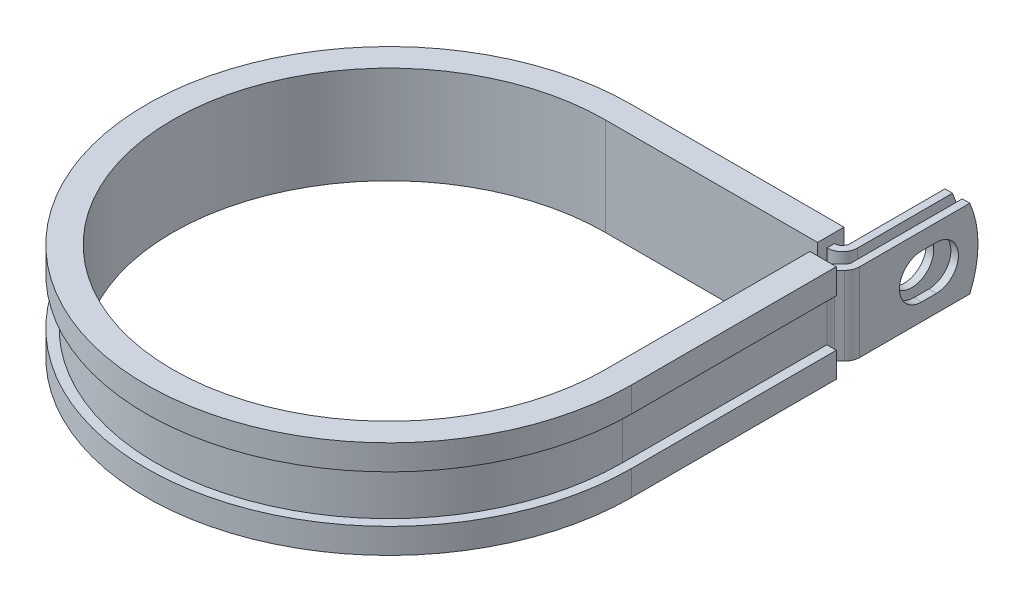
ISO-10303-21;
HEADER;
FILE_DESCRIPTION(('STEP AP214'),'2;1');
FILE_NAME('part.step','',(''),(''),'','','');
FILE_SCHEMA(('AUTOMOTIVE_DESIGN { 1 0 10303 214 1 1 1 1 }'));
ENDSEC;
DATA;
#1=APPLICATION_CONTEXT('core data for automotive mechanical design processes');
#2=APPLICATION_PROTOCOL_DEFINITION('international standard','automotive_design',2000,#1);
#3=PRODUCT_CONTEXT('',#1,'mechanical');
#4=PRODUCT('Part','Part','',(#3));
#5=PRODUCT_RELATED_PRODUCT_CATEGORY('part','',(#4));
#6=PRODUCT_DEFINITION_FORMATION('','',#4);
#7=PRODUCT_DEFINITION_CONTEXT('part definition',#1,'design');
#8=PRODUCT_DEFINITION('design','',#6,#7);
#9=PRODUCT_DEFINITION_SHAPE('','',#8);
#10=(LENGTH_UNIT() NAMED_UNIT(*) SI_UNIT(.MILLI.,.METRE.));
#11=(NAMED_UNIT(*) PLANE_ANGLE_UNIT() SI_UNIT($,.RADIAN.));
#12=(NAMED_UNIT(*) SI_UNIT($,.STERADIAN.) SOLID_ANGLE_UNIT());
#13=UNCERTAINTY_MEASURE_WITH_UNIT(LENGTH_MEASURE(1.E-05),#10,'distance_accuracy_value','');
#14=(GEOMETRIC_REPRESENTATION_CONTEXT(3) GLOBAL_UNCERTAINTY_ASSIGNED_CONTEXT((#13)) GLOBAL_UNIT_ASSIGNED_CONTEXT((#10,
#11,#12)) REPRESENTATION_CONTEXT('',''));
#15=CARTESIAN_POINT('',(0.,0.,0.));
#16=DIRECTION('',(0.,0.,1.));
#17=DIRECTION('',(1.,0.,0.));
#18=AXIS2_PLACEMENT_3D('',#15,#16,#17);
#19=CARTESIAN_POINT('',(37.1272698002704,-6.35,-36.449));
#20=DIRECTION('',(0.,1.,0.));
#21=DIRECTION('',(1.,0.,0.));
#22=AXIS2_PLACEMENT_3D('',#19,#20,#21);
#23=PLANE('',#22);
#24=DIRECTION('',(0.,0.,-1.));
#25=VECTOR('',#24,1.);
#26=CARTESIAN_POINT('',(34.2824698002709,-6.35,-36.449));
#27=LINE('',#26,#25);
#28=CARTESIAN_POINT('',(34.2824698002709,-6.35,-36.449));
#29=VERTEX_POINT('',#28);
#30=CARTESIAN_POINT('',(34.282469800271,-6.35,-37.6682));
#31=VERTEX_POINT('',#30);
#32=EDGE_CURVE('E523',#29,#31,#27,.T.);
#33=ORIENTED_EDGE('',*,*,#32,.T.);
#34=DIRECTION('',(1.,0.,0.));
#35=VECTOR('',#34,1.);
#36=CARTESIAN_POINT('',(0.,-6.35,-37.6682));
#37=LINE('',#36,#35);
#38=CARTESIAN_POINT('',(34.3332698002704,-6.35,-37.6682));
#39=VERTEX_POINT('',#38);
#40=EDGE_CURVE('E410',#39,#31,#37,.F.);
#41=ORIENTED_EDGE('',*,*,#40,.F.);
#42=CARTESIAN_POINT('',(34.3332698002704,-6.35,-38.8874));
#43=DIRECTION('',(0.,1.,0.));
#44=DIRECTION('',(1.,0.,0.));
#45=AXIS2_PLACEMENT_3D('',#42,#43,#44);
#46=CIRCLE('',#45,1.2192);
#47=CARTESIAN_POINT('',(35.5524698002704,-6.35,-38.8874));
#48=VERTEX_POINT('',#47);
#49=EDGE_CURVE('E408',#48,#39,#46,.F.);
#50=ORIENTED_EDGE('',*,*,#49,.F.);
#51=DIRECTION('',(0.,0.,-1.));
#52=VECTOR('',#51,1.);
#53=CARTESIAN_POINT('',(35.5524698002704,-6.35,-55.5498));
#54=LINE('',#53,#52);
#55=CARTESIAN_POINT('',(35.5524698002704,-6.35,-54.2244778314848));
#56=VERTEX_POINT('',#55);
#57=EDGE_CURVE('E406',#56,#48,#54,.F.);
#58=ORIENTED_EDGE('',*,*,#57,.F.);
#59=DIRECTION('',(-1.,0.,0.));
#60=VECTOR('',#59,1.);
#61=CARTESIAN_POINT('',(39.5656698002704,-6.35,-54.2244778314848));
#62=LINE('',#61,#60);
#63=CARTESIAN_POINT('',(36.7716698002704,-6.35,-54.2244778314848));
#64=VERTEX_POINT('',#63);
#65=EDGE_CURVE('E12',#64,#56,#62,.T.);
#66=ORIENTED_EDGE('',*,*,#65,.F.);
#67=DIRECTION('',(0.,0.,1.));
#68=VECTOR('',#67,1.);
#69=CARTESIAN_POINT('',(36.7716698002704,-6.35,-55.5498));
#70=LINE('',#69,#68);
#71=CARTESIAN_POINT('',(36.7716698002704,-6.35,-38.8874));
#72=VERTEX_POINT('',#71);
#73=EDGE_CURVE('E404',#64,#72,#70,.T.);
#74=ORIENTED_EDGE('',*,*,#73,.T.);
#75=CARTESIAN_POINT('',(34.3332698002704,-6.35,-38.8874));
#76=DIRECTION('',(0.,-1.,0.));
#77=DIRECTION('',(0.,0.,1.));
#78=AXIS2_PLACEMENT_3D('',#75,#76,#77);
#79=CIRCLE('',#78,2.4384);
#80=CARTESIAN_POINT('',(34.3332698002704,-6.35,-36.449));
#81=VERTEX_POINT('',#80);
#82=EDGE_CURVE('E401',#72,#81,#79,.T.);
#83=ORIENTED_EDGE('',*,*,#82,.T.);
#84=DIRECTION('',(-1.,0.,0.));
#85=VECTOR('',#84,1.);
#86=CARTESIAN_POINT('',(0.,-6.35,-36.449));
#87=LINE('',#86,#85);
#88=EDGE_CURVE('E398',#81,#29,#87,.T.);
#89=ORIENTED_EDGE('',*,*,#88,.T.);
#90=EDGE_LOOP('',(#33,#41,#50,#58,#66,#74,#83,#89));
#91=FACE_BOUND('',#90,.T.);
#92=ADVANCED_FACE('F54',(#91),#23,.F.);
#93=CARTESIAN_POINT('',(37.1272698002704,6.35,-36.449));
#94=DIRECTION('',(0.,1.,0.));
#95=DIRECTION('',(1.,0.,0.));
#96=AXIS2_PLACEMENT_3D('',#93,#94,#95);
#97=PLANE('',#96);
#98=DIRECTION('',(1.,0.,0.));
#99=VECTOR('',#98,1.);
#100=CARTESIAN_POINT('',(0.,6.35,-37.6682));
#101=LINE('',#100,#99);
#102=CARTESIAN_POINT('',(34.3332698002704,6.35,-37.6682));
#103=VERTEX_POINT('',#102);
#104=CARTESIAN_POINT('',(34.282469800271,6.35,-37.6682));
#105=VERTEX_POINT('',#104);
#106=EDGE_CURVE('E368',#103,#105,#101,.F.);
#107=ORIENTED_EDGE('',*,*,#106,.T.);
#108=DIRECTION('',(0.,0.,1.));
#109=VECTOR('',#108,1.);
#110=CARTESIAN_POINT('',(34.282469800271,6.35,-37.6682));
#111=LINE('',#110,#109);
#112=CARTESIAN_POINT('',(34.2824698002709,6.35,-36.449));
#113=VERTEX_POINT('',#112);
#114=EDGE_CURVE('E517',#105,#113,#111,.T.);
#115=ORIENTED_EDGE('',*,*,#114,.T.);
#116=DIRECTION('',(-1.,0.,0.));
#117=VECTOR('',#116,1.);
#118=CARTESIAN_POINT('',(0.,6.35,-36.449));
#119=LINE('',#118,#117);
#120=CARTESIAN_POINT('',(34.3332698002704,6.35,-36.449));
#121=VERTEX_POINT('',#120);
#122=EDGE_CURVE('E625',#121,#113,#119,.T.);
#123=ORIENTED_EDGE('',*,*,#122,.F.);
#124=CARTESIAN_POINT('',(34.3332698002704,6.35,-38.8874));
#125=DIRECTION('',(0.,-1.,0.));
#126=DIRECTION('',(0.,0.,1.));
#127=AXIS2_PLACEMENT_3D('',#124,#125,#126);
#128=CIRCLE('',#127,2.4384);
#129=CARTESIAN_POINT('',(36.7716698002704,6.35,-38.8874));
#130=VERTEX_POINT('',#129);
#131=EDGE_CURVE('E370',#130,#121,#128,.T.);
#132=ORIENTED_EDGE('',*,*,#131,.F.);
#133=DIRECTION('',(0.,0.,1.));
#134=VECTOR('',#133,1.);
#135=CARTESIAN_POINT('',(36.7716698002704,6.35,-55.5498));
#136=LINE('',#135,#134);
#137=CARTESIAN_POINT('',(36.7716698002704,6.35,-54.2244778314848));
#138=VERTEX_POINT('',#137);
#139=EDGE_CURVE('E361',#138,#130,#136,.T.);
#140=ORIENTED_EDGE('',*,*,#139,.F.);
#141=DIRECTION('',(-1.,0.,0.));
#142=VECTOR('',#141,1.);
#143=CARTESIAN_POINT('',(39.5656698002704,6.35,-54.2244778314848));
#144=LINE('',#143,#142);
#145=CARTESIAN_POINT('',(35.5524698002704,6.35,-54.2244778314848));
#146=VERTEX_POINT('',#145);
#147=EDGE_CURVE('E62',#138,#146,#144,.T.);
#148=ORIENTED_EDGE('',*,*,#147,.T.);
#149=DIRECTION('',(0.,0.,-1.));
#150=VECTOR('',#149,1.);
#151=CARTESIAN_POINT('',(35.5524698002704,6.35,-55.5498));
#152=LINE('',#151,#150);
#153=CARTESIAN_POINT('',(35.5524698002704,6.35,-38.8874));
#154=VERTEX_POINT('',#153);
#155=EDGE_CURVE('E358',#146,#154,#152,.F.);
#156=ORIENTED_EDGE('',*,*,#155,.T.);
#157=CARTESIAN_POINT('',(34.3332698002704,6.35,-38.8874));
#158=DIRECTION('',(0.,1.,0.));
#159=DIRECTION('',(1.,0.,0.));
#160=AXIS2_PLACEMENT_3D('',#157,#158,#159);
#161=CIRCLE('',#160,1.2192);
#162=EDGE_CURVE('E366',#154,#103,#161,.F.);
#163=ORIENTED_EDGE('',*,*,#162,.T.);
#164=EDGE_LOOP('',(#107,#115,#123,#132,#140,#148,#156,#163));
#165=FACE_BOUND('',#164,.T.);
#166=ADVANCED_FACE('F357',(#165),#97,.T.);
#167=CARTESIAN_POINT('',(0.,6.35,-36.449));
#168=DIRECTION('',(0.,0.,1.));
#169=DIRECTION('',(1.,0.,0.));
#170=AXIS2_PLACEMENT_3D('',#167,#168,#169);
#171=PLANE('',#170);
#172=ORIENTED_EDGE('',*,*,#122,.T.);
#173=DIRECTION('',(0.,-1.,0.));
#174=VECTOR('',#173,1.);
#175=CARTESIAN_POINT('',(34.2824698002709,6.35,-36.449));
#176=LINE('',#175,#174);
#177=EDGE_CURVE('E520',#113,#29,#176,.T.);
#178=ORIENTED_EDGE('',*,*,#177,.T.);
#179=ORIENTED_EDGE('',*,*,#88,.F.);
#180=DIRECTION('',(0.,-1.,0.));
#181=VECTOR('',#180,1.);
#182=CARTESIAN_POINT('',(34.3332698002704,6.35,-36.449));
#183=LINE('',#182,#181);
#184=EDGE_CURVE('E344',#121,#81,#183,.T.);
#185=ORIENTED_EDGE('',*,*,#184,.F.);
#186=EDGE_LOOP('',(#172,#178,#179,#185));
#187=FACE_BOUND('',#186,.T.);
#188=ADVANCED_FACE('F635',(#187),#171,.T.);
#189=CARTESIAN_POINT('',(39.5656698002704,6.35,-36.449));
#190=DIRECTION('',(-1.,0.,0.));
#191=DIRECTION('',(0.,0.,1.));
#192=AXIS2_PLACEMENT_3D('',#189,#190,#191);
#193=PLANE('',#192);
#194=CARTESIAN_POINT('',(39.5656698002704,0.,-48.8187999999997));
#195=DIRECTION('',(1.,0.,0.));
#196=DIRECTION('',(0.,0.,-1.));
#197=AXIS2_PLACEMENT_3D('',#194,#195,#196);
#198=CIRCLE('',#197,3.5687);
#199=CARTESIAN_POINT('',(39.5656698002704,-3.5687,-48.8188000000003));
#200=VERTEX_POINT('',#199);
#201=CARTESIAN_POINT('',(39.5656698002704,3.5687,-48.8188000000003));
#202=VERTEX_POINT('',#201);
#203=EDGE_CURVE('E580',#200,#202,#198,.T.);
#204=ORIENTED_EDGE('',*,*,#203,.F.);
#205=DIRECTION('',(0.,0.,-1.));
#206=VECTOR('',#205,1.);
#207=CARTESIAN_POINT('',(39.5656698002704,-3.5687,-46.4311999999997));
#208=LINE('',#207,#206);
#209=CARTESIAN_POINT('',(39.5656698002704,-3.5687,-46.4311999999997));
#210=VERTEX_POINT('',#209);
#211=EDGE_CURVE('E583',#210,#200,#208,.T.);
#212=ORIENTED_EDGE('',*,*,#211,.F.);
#213=CARTESIAN_POINT('',(39.5656698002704,0.,-46.4311999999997));
#214=DIRECTION('',(1.,0.,0.));
#215=DIRECTION('',(0.,0.,-1.));
#216=AXIS2_PLACEMENT_3D('',#213,#214,#215);
#217=CIRCLE('',#216,3.5687);
#218=CARTESIAN_POINT('',(39.5656698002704,3.5687,-46.4311999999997));
#219=VERTEX_POINT('',#218);
#220=EDGE_CURVE('E576',#219,#210,#217,.T.);
#221=ORIENTED_EDGE('',*,*,#220,.F.);
#222=DIRECTION('',(0.,0.,1.));
#223=VECTOR('',#222,1.);
#224=CARTESIAN_POINT('',(39.5656698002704,3.5687,-46.4311999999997));
#225=LINE('',#224,#223);
#226=EDGE_CURVE('E577',#202,#219,#225,.T.);
#227=ORIENTED_EDGE('',*,*,#226,.F.);
#228=EDGE_LOOP('',(#204,#212,#221,#227));
#229=FACE_BOUND('',#228,.T.);
#230=DIRECTION('',(0.,0.,-1.));
#231=VECTOR('',#230,1.);
#232=CARTESIAN_POINT('',(39.5656698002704,-6.35,-36.449));
#233=LINE('',#232,#231);
#234=CARTESIAN_POINT('',(39.5656698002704,-6.35,-36.449));
#235=VERTEX_POINT('',#234);
#236=CARTESIAN_POINT('',(39.5656698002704,-6.35,-54.2244778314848));
#237=VERTEX_POINT('',#236);
#238=EDGE_CURVE('E382',#235,#237,#233,.T.);
#239=ORIENTED_EDGE('',*,*,#238,.T.);
#240=CARTESIAN_POINT('',(39.5656698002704,0.,-39.6748));
#241=DIRECTION('',(-1.,0.,0.));
#242=DIRECTION('',(0.,0.,1.));
#243=AXIS2_PLACEMENT_3D('',#240,#241,#242);
#244=CIRCLE('',#243,15.875);
#245=CARTESIAN_POINT('',(39.5656698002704,6.35,-54.2244778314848));
#246=VERTEX_POINT('',#245);
#247=EDGE_CURVE('E568',#246,#237,#244,.T.);
#248=ORIENTED_EDGE('',*,*,#247,.F.);
#249=DIRECTION('',(0.,0.,-1.));
#250=VECTOR('',#249,1.);
#251=CARTESIAN_POINT('',(39.5656698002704,6.35,-36.449));
#252=LINE('',#251,#250);
#253=CARTESIAN_POINT('',(39.5656698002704,6.35,-36.449));
#254=VERTEX_POINT('',#253);
#255=EDGE_CURVE('E419',#254,#246,#252,.T.);
#256=ORIENTED_EDGE('',*,*,#255,.F.);
#257=DIRECTION('',(0.,-1.,0.));
#258=VECTOR('',#257,1.);
#259=CARTESIAN_POINT('',(39.5656698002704,6.35,-36.449));
#260=LINE('',#259,#258);
#261=EDGE_CURVE('E381',#254,#235,#260,.T.);
#262=ORIENTED_EDGE('',*,*,#261,.T.);
#263=EDGE_LOOP('',(#239,#248,#256,#262));
#264=FACE_BOUND('',#263,.T.);
#265=ADVANCED_FACE('F56',(#229,#264),#193,.F.);
#266=CARTESIAN_POINT('',(38.3464698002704,6.35,-36.449));
#267=DIRECTION('',(-1.,0.,0.));
#268=DIRECTION('',(0.,0.,1.));
#269=AXIS2_PLACEMENT_3D('',#266,#267,#268);
#270=PLANE('',#269);
#271=DIRECTION('',(0.,0.,-1.));
#272=VECTOR('',#271,1.);
#273=CARTESIAN_POINT('',(38.3464698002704,-3.5687,-46.4311999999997));
#274=LINE('',#273,#272);
#275=CARTESIAN_POINT('',(38.3464698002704,-3.5687,-46.4311999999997));
#276=VERTEX_POINT('',#275);
#277=CARTESIAN_POINT('',(38.3464698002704,-3.5687,-48.8188000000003));
#278=VERTEX_POINT('',#277);
#279=EDGE_CURVE('E579',#276,#278,#274,.T.);
#280=ORIENTED_EDGE('',*,*,#279,.T.);
#281=CARTESIAN_POINT('',(38.3464698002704,0.,-48.8187999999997));
#282=DIRECTION('',(-1.,0.,0.));
#283=DIRECTION('',(0.,0.,1.));
#284=AXIS2_PLACEMENT_3D('',#281,#282,#283);
#285=CIRCLE('',#284,3.5687);
#286=CARTESIAN_POINT('',(38.3464698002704,3.5687,-48.8188000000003));
#287=VERTEX_POINT('',#286);
#288=EDGE_CURVE('E600',#278,#287,#285,.F.);
#289=ORIENTED_EDGE('',*,*,#288,.T.);
#290=DIRECTION('',(0.,0.,1.));
#291=VECTOR('',#290,1.);
#292=CARTESIAN_POINT('',(38.3464698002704,3.5687,-46.4311999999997));
#293=LINE('',#292,#291);
#294=CARTESIAN_POINT('',(38.3464698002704,3.5687,-46.4311999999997));
#295=VERTEX_POINT('',#294);
#296=EDGE_CURVE('E596',#287,#295,#293,.T.);
#297=ORIENTED_EDGE('',*,*,#296,.T.);
#298=CARTESIAN_POINT('',(38.3464698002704,0.,-46.4311999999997));
#299=DIRECTION('',(-1.,0.,0.));
#300=DIRECTION('',(0.,0.,1.));
#301=AXIS2_PLACEMENT_3D('',#298,#299,#300);
#302=CIRCLE('',#301,3.5687);
#303=EDGE_CURVE('E591',#295,#276,#302,.F.);
#304=ORIENTED_EDGE('',*,*,#303,.T.);
#305=EDGE_LOOP('',(#280,#289,#297,#304));
#306=FACE_BOUND('',#305,.T.);
#307=CARTESIAN_POINT('',(38.3464698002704,0.,-39.6748));
#308=DIRECTION('',(-1.,0.,0.));
#309=DIRECTION('',(0.,0.,1.));
#310=AXIS2_PLACEMENT_3D('',#307,#308,#309);
#311=CIRCLE('',#310,15.875);
#312=CARTESIAN_POINT('',(38.3464698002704,6.35,-54.2244778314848));
#313=VERTEX_POINT('',#312);
#314=CARTESIAN_POINT('',(38.3464698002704,-6.35,-54.2244778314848));
#315=VERTEX_POINT('',#314);
#316=EDGE_CURVE('E76',#313,#315,#311,.T.);
#317=ORIENTED_EDGE('',*,*,#316,.T.);
#318=DIRECTION('',(0.,0.,-1.));
#319=VECTOR('',#318,1.);
#320=CARTESIAN_POINT('',(38.3464698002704,-6.35,-36.449));
#321=LINE('',#320,#319);
#322=CARTESIAN_POINT('',(38.3464698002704,-6.35,-36.449));
#323=VERTEX_POINT('',#322);
#324=EDGE_CURVE('E385',#323,#315,#321,.T.);
#325=ORIENTED_EDGE('',*,*,#324,.F.);
#326=DIRECTION('',(0.,-1.,0.));
#327=VECTOR('',#326,1.);
#328=CARTESIAN_POINT('',(38.3464698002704,6.35,-36.449));
#329=LINE('',#328,#327);
#330=CARTESIAN_POINT('',(38.3464698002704,6.35,-36.449));
#331=VERTEX_POINT('',#330);
#332=EDGE_CURVE('E352',#331,#323,#329,.T.);
#333=ORIENTED_EDGE('',*,*,#332,.F.);
#334=DIRECTION('',(0.,0.,-1.));
#335=VECTOR('',#334,1.);
#336=CARTESIAN_POINT('',(38.3464698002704,6.35,-36.449));
#337=LINE('',#336,#335);
#338=EDGE_CURVE('E615',#331,#313,#337,.T.);
#339=ORIENTED_EDGE('',*,*,#338,.T.);
#340=EDGE_LOOP('',(#317,#325,#333,#339));
#341=FACE_BOUND('',#340,.T.);
#342=ADVANCED_FACE('F689',(#306,#341),#270,.T.);
#343=CARTESIAN_POINT('',(36.7716698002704,6.35,-55.5498));
#344=DIRECTION('',(1.,0.,0.));
#345=DIRECTION('',(0.,0.,-1.));
#346=AXIS2_PLACEMENT_3D('',#343,#344,#345);
#347=PLANE('',#346);
#348=CARTESIAN_POINT('',(36.7716698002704,0.,-47.625));
#349=DIRECTION('',(1.,0.,0.));
#350=DIRECTION('',(0.,0.,-1.));
#351=AXIS2_PLACEMENT_3D('',#348,#349,#350);
#352=CIRCLE('',#351,3.5687);
#353=CARTESIAN_POINT('',(36.7716698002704,0.,-51.1937));
#354=VERTEX_POINT('',#353);
#355=EDGE_CURVE('E386',#354,#354,#352,.F.);
#356=ORIENTED_EDGE('',*,*,#355,.T.);
#357=EDGE_LOOP('',(#356));
#358=FACE_BOUND('',#357,.T.);
#359=ORIENTED_EDGE('',*,*,#73,.F.);
#360=CARTESIAN_POINT('',(36.7716698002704,0.,-39.6748));
#361=DIRECTION('',(1.,0.,0.));
#362=DIRECTION('',(0.,0.,-1.));
#363=AXIS2_PLACEMENT_3D('',#360,#361,#362);
#364=CIRCLE('',#363,15.875);
#365=EDGE_CURVE('E573',#64,#138,#364,.T.);
#366=ORIENTED_EDGE('',*,*,#365,.T.);
#367=ORIENTED_EDGE('',*,*,#139,.T.);
#368=DIRECTION('',(0.,-1.,0.));
#369=VECTOR('',#368,1.);
#370=CARTESIAN_POINT('',(36.7716698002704,6.35,-38.8874));
#371=LINE('',#370,#369);
#372=EDGE_CURVE('E341',#130,#72,#371,.T.);
#373=ORIENTED_EDGE('',*,*,#372,.T.);
#374=EDGE_LOOP('',(#359,#366,#367,#373));
#375=FACE_BOUND('',#374,.T.);
#376=ADVANCED_FACE('F641',(#358,#375),#347,.T.);
#377=CARTESIAN_POINT('',(35.5524698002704,6.35,-55.5498));
#378=DIRECTION('',(1.,0.,0.));
#379=DIRECTION('',(0.,0.,-1.));
#380=AXIS2_PLACEMENT_3D('',#377,#378,#379);
#381=PLANE('',#380);
#382=CARTESIAN_POINT('',(35.5524698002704,0.,-47.625));
#383=DIRECTION('',(-1.,0.,0.));
#384=DIRECTION('',(0.,0.,1.));
#385=AXIS2_PLACEMENT_3D('',#382,#383,#384);
#386=CIRCLE('',#385,3.5687);
#387=CARTESIAN_POINT('',(35.5524698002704,0.,-44.0563));
#388=VERTEX_POINT('',#387);
#389=EDGE_CURVE('E608',#388,#388,#386,.T.);
#390=ORIENTED_EDGE('',*,*,#389,.F.);
#391=EDGE_LOOP('',(#390));
#392=FACE_BOUND('',#391,.T.);
#393=CARTESIAN_POINT('',(35.5524698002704,0.,-39.6748));
#394=DIRECTION('',(-1.,0.,0.));
#395=DIRECTION('',(0.,0.,1.));
#396=AXIS2_PLACEMENT_3D('',#393,#394,#395);
#397=CIRCLE('',#396,15.875);
#398=EDGE_CURVE('E68',#146,#56,#397,.T.);
#399=ORIENTED_EDGE('',*,*,#398,.T.);
#400=ORIENTED_EDGE('',*,*,#57,.T.);
#401=DIRECTION('',(0.,-1.,0.));
#402=VECTOR('',#401,1.);
#403=CARTESIAN_POINT('',(35.5524698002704,6.35,-38.8874));
#404=LINE('',#403,#402);
#405=EDGE_CURVE('E338',#154,#48,#404,.T.);
#406=ORIENTED_EDGE('',*,*,#405,.F.);
#407=ORIENTED_EDGE('',*,*,#155,.F.);
#408=EDGE_LOOP('',(#399,#400,#406,#407));
#409=FACE_BOUND('',#408,.T.);
#410=ADVANCED_FACE('F364',(#392,#409),#381,.F.);
#411=CARTESIAN_POINT('',(38.8874,-6.35,-33.0365026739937));
#412=DIRECTION('',(0.,1.,0.));
#413=DIRECTION('',(1.,0.,0.));
#414=AXIS2_PLACEMENT_3D('',#411,#412,#413);
#415=CIRCLE('',#414,1.2192);
#416=CARTESIAN_POINT('',(37.6682,-6.35,-33.0365026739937));
#417=VERTEX_POINT('',#416);
#418=CARTESIAN_POINT('',(38.0252954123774,-6.35,-33.8986072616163));
#419=VERTEX_POINT('',#418);
#420=EDGE_CURVE('E413',#417,#419,#415,.F.);
#421=ORIENTED_EDGE('',*,*,#420,.F.);
#422=DIRECTION('',(1.,0.,0.));
#423=VECTOR('',#422,1.);
#424=CARTESIAN_POINT('',(36.449,-6.35,-33.0365026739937));
#425=LINE('',#424,#423);
#426=CARTESIAN_POINT('',(36.449,-6.35,-33.0365026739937));
#427=VERTEX_POINT('',#426);
#428=EDGE_CURVE('E451',#427,#417,#425,.T.);
#429=ORIENTED_EDGE('',*,*,#428,.F.);
#430=CARTESIAN_POINT('',(38.8874,-6.35,-33.0365026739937));
#431=DIRECTION('',(0.,-1.,0.));
#432=DIRECTION('',(0.,0.,1.));
#433=AXIS2_PLACEMENT_3D('',#430,#431,#432);
#434=CIRCLE('',#433,2.4384);
#435=CARTESIAN_POINT('',(37.1631908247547,-6.35,-34.760711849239));
#436=VERTEX_POINT('',#435);
#437=EDGE_CURVE('E395',#427,#436,#434,.T.);
#438=ORIENTED_EDGE('',*,*,#437,.T.);
#439=DIRECTION('',(0.707106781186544,0.,-0.70710678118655));
#440=VECTOR('',#439,1.);
#441=CARTESIAN_POINT('',(37.1631908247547,-6.35,-34.760711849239));
#442=LINE('',#441,#440);
#443=CARTESIAN_POINT('',(37.9893743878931,-6.35,-35.5868954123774));
#444=VERTEX_POINT('',#443);
#445=EDGE_CURVE('E392',#436,#444,#442,.T.);
#446=ORIENTED_EDGE('',*,*,#445,.T.);
#447=CARTESIAN_POINT('',(37.1272698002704,-6.35,-36.449));
#448=DIRECTION('',(0.,1.,0.));
#449=DIRECTION('',(0.,0.,1.));
#450=AXIS2_PLACEMENT_3D('',#447,#448,#449);
#451=CIRCLE('',#450,1.2192);
#452=EDGE_CURVE('E389',#444,#323,#451,.T.);
#453=ORIENTED_EDGE('',*,*,#452,.T.);
#454=ORIENTED_EDGE('',*,*,#324,.T.);
#455=DIRECTION('',(-1.,0.,0.));
#456=VECTOR('',#455,1.);
#457=CARTESIAN_POINT('',(39.5656698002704,-6.35,-54.2244778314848));
#458=LINE('',#457,#456);
#459=EDGE_CURVE('E566',#237,#315,#458,.T.);
#460=ORIENTED_EDGE('',*,*,#459,.F.);
#461=ORIENTED_EDGE('',*,*,#238,.F.);
#462=CARTESIAN_POINT('',(37.1272698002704,-6.35,-36.449));
#463=DIRECTION('',(0.,1.,0.));
#464=DIRECTION('',(1.,0.,0.));
#465=AXIS2_PLACEMENT_3D('',#462,#463,#464);
#466=CIRCLE('',#465,2.4384);
#467=CARTESIAN_POINT('',(38.8514789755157,-6.35,-34.7247908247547));
#468=VERTEX_POINT('',#467);
#469=EDGE_CURVE('E417',#468,#235,#466,.T.);
#470=ORIENTED_EDGE('',*,*,#469,.F.);
#471=DIRECTION('',(0.707106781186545,0.,-0.707106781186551));
#472=VECTOR('',#471,1.);
#473=CARTESIAN_POINT('',(38.0252954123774,-6.35,-33.8986072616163));
#474=LINE('',#473,#472);
#475=EDGE_CURVE('E415',#419,#468,#474,.T.);
#476=ORIENTED_EDGE('',*,*,#475,.F.);
#477=EDGE_LOOP('',(#421,#429,#438,#446,#453,#454,#460,#461,#470,#476));
#478=FACE_BOUND('',#477,.T.);
#479=ADVANCED_FACE('F675',(#478),#23,.F.);
#480=DIRECTION('',(-1.,0.,0.));
#481=VECTOR('',#480,1.);
#482=CARTESIAN_POINT('',(37.6682,6.35,-33.0365026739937));
#483=LINE('',#482,#481);
#484=CARTESIAN_POINT('',(37.6682,6.35,-33.0365026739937));
#485=VERTEX_POINT('',#484);
#486=CARTESIAN_POINT('',(36.449,6.35,-33.0365026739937));
#487=VERTEX_POINT('',#486);
#488=EDGE_CURVE('E440',#485,#487,#483,.T.);
#489=ORIENTED_EDGE('',*,*,#488,.F.);
#490=CARTESIAN_POINT('',(38.8874,6.35,-33.0365026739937));
#491=DIRECTION('',(0.,1.,0.));
#492=DIRECTION('',(1.,0.,0.));
#493=AXIS2_PLACEMENT_3D('',#490,#491,#492);
#494=CIRCLE('',#493,1.2192);
#495=CARTESIAN_POINT('',(38.0252954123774,6.35,-33.8986072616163));
#496=VERTEX_POINT('',#495);
#497=EDGE_CURVE('E375',#485,#496,#494,.F.);
#498=ORIENTED_EDGE('',*,*,#497,.T.);
#499=DIRECTION('',(0.707106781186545,0.,-0.707106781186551));
#500=VECTOR('',#499,1.);
#501=CARTESIAN_POINT('',(38.0252954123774,6.35,-33.8986072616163));
#502=LINE('',#501,#500);
#503=CARTESIAN_POINT('',(38.8514789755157,6.35,-34.7247908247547));
#504=VERTEX_POINT('',#503);
#505=EDGE_CURVE('E377',#496,#504,#502,.T.);
#506=ORIENTED_EDGE('',*,*,#505,.T.);
#507=CARTESIAN_POINT('',(37.1272698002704,6.35,-36.449));
#508=DIRECTION('',(0.,1.,0.));
#509=DIRECTION('',(1.,0.,0.));
#510=AXIS2_PLACEMENT_3D('',#507,#508,#509);
#511=CIRCLE('',#510,2.4384);
#512=EDGE_CURVE('E379',#504,#254,#511,.T.);
#513=ORIENTED_EDGE('',*,*,#512,.T.);
#514=ORIENTED_EDGE('',*,*,#255,.T.);
#515=DIRECTION('',(-1.,0.,0.));
#516=VECTOR('',#515,1.);
#517=CARTESIAN_POINT('',(39.5656698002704,6.35,-54.2244778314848));
#518=LINE('',#517,#516);
#519=EDGE_CURVE('E570',#246,#313,#518,.T.);
#520=ORIENTED_EDGE('',*,*,#519,.T.);
#521=ORIENTED_EDGE('',*,*,#338,.F.);
#522=CARTESIAN_POINT('',(37.1272698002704,6.35,-36.449));
#523=DIRECTION('',(0.,1.,0.));
#524=DIRECTION('',(0.,0.,1.));
#525=AXIS2_PLACEMENT_3D('',#522,#523,#524);
#526=CIRCLE('',#525,1.2192);
#527=CARTESIAN_POINT('',(37.9893743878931,6.35,-35.5868954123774));
#528=VERTEX_POINT('',#527);
#529=EDGE_CURVE('E618',#528,#331,#526,.T.);
#530=ORIENTED_EDGE('',*,*,#529,.F.);
#531=DIRECTION('',(0.707106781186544,0.,-0.70710678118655));
#532=VECTOR('',#531,1.);
#533=CARTESIAN_POINT('',(37.1631908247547,6.35,-34.760711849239));
#534=LINE('',#533,#532);
#535=CARTESIAN_POINT('',(37.1631908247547,6.35,-34.760711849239));
#536=VERTEX_POINT('',#535);
#537=EDGE_CURVE('E621',#536,#528,#534,.T.);
#538=ORIENTED_EDGE('',*,*,#537,.F.);
#539=CARTESIAN_POINT('',(38.8874,6.35,-33.0365026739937));
#540=DIRECTION('',(0.,-1.,0.));
#541=DIRECTION('',(0.,0.,1.));
#542=AXIS2_PLACEMENT_3D('',#539,#540,#541);
#543=CIRCLE('',#542,2.4384);
#544=EDGE_CURVE('E450',#487,#536,#543,.T.);
#545=ORIENTED_EDGE('',*,*,#544,.F.);
#546=EDGE_LOOP('',(#489,#498,#506,#513,#514,#520,#521,#530,#538,#545));
#547=FACE_BOUND('',#546,.T.);
#548=ADVANCED_FACE('F447',(#547),#97,.T.);
#549=CARTESIAN_POINT('',(37.1272698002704,6.35,-36.449));
#550=DIRECTION('',(0.,-1.,0.));
#551=DIRECTION('',(0.,0.,-1.));
#552=AXIS2_PLACEMENT_3D('',#549,#550,#551);
#553=CYLINDRICAL_SURFACE('',#552,1.2192);
#554=ORIENTED_EDGE('',*,*,#452,.F.);
#555=DIRECTION('',(0.,-1.,0.));
#556=VECTOR('',#555,1.);
#557=CARTESIAN_POINT('',(37.9893743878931,6.35,-35.5868954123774));
#558=LINE('',#557,#556);
#559=EDGE_CURVE('E350',#528,#444,#558,.T.);
#560=ORIENTED_EDGE('',*,*,#559,.F.);
#561=ORIENTED_EDGE('',*,*,#529,.T.);
#562=ORIENTED_EDGE('',*,*,#332,.T.);
#563=EDGE_LOOP('',(#554,#560,#561,#562));
#564=FACE_BOUND('',#563,.T.);
#565=ADVANCED_FACE('F685',(#564),#553,.F.);
#566=CARTESIAN_POINT('',(37.1631908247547,6.35,-34.760711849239));
#567=DIRECTION('',(-0.707106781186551,0.,-0.707106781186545));
#568=DIRECTION('',(-0.707106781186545,0.,0.707106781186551));
#569=AXIS2_PLACEMENT_3D('',#566,#567,#568);
#570=PLANE('',#569);
#571=ORIENTED_EDGE('',*,*,#445,.F.);
#572=DIRECTION('',(0.,-1.,0.));
#573=VECTOR('',#572,1.);
#574=CARTESIAN_POINT('',(37.1631908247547,6.35,-34.760711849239));
#575=LINE('',#574,#573);
#576=EDGE_CURVE('E348',#536,#436,#575,.T.);
#577=ORIENTED_EDGE('',*,*,#576,.F.);
#578=ORIENTED_EDGE('',*,*,#537,.T.);
#579=ORIENTED_EDGE('',*,*,#559,.T.);
#580=EDGE_LOOP('',(#571,#577,#578,#579));
#581=FACE_BOUND('',#580,.T.);
#582=ADVANCED_FACE('F680',(#581),#570,.T.);
#583=CARTESIAN_POINT('',(38.8874,6.35,-33.0365026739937));
#584=DIRECTION('',(0.,-1.,0.));
#585=DIRECTION('',(0.,0.,-1.));
#586=AXIS2_PLACEMENT_3D('',#583,#584,#585);
#587=CYLINDRICAL_SURFACE('',#586,2.4384);
#588=ORIENTED_EDGE('',*,*,#437,.F.);
#589=DIRECTION('',(0.,-1.,0.));
#590=VECTOR('',#589,1.);
#591=CARTESIAN_POINT('',(36.449,6.35,-33.0365026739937));
#592=LINE('',#591,#590);
#593=EDGE_CURVE('E346',#487,#427,#592,.T.);
#594=ORIENTED_EDGE('',*,*,#593,.F.);
#595=ORIENTED_EDGE('',*,*,#544,.T.);
#596=ORIENTED_EDGE('',*,*,#576,.T.);
#597=EDGE_LOOP('',(#588,#594,#595,#596));
#598=FACE_BOUND('',#597,.T.);
#599=ADVANCED_FACE('F677',(#598),#587,.T.);
#600=CARTESIAN_POINT('',(34.3332698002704,6.35,-38.8874));
#601=DIRECTION('',(0.,-1.,0.));
#602=DIRECTION('',(0.,0.,-1.));
#603=AXIS2_PLACEMENT_3D('',#600,#601,#602);
#604=CYLINDRICAL_SURFACE('',#603,2.4384);
#605=ORIENTED_EDGE('',*,*,#82,.F.);
#606=ORIENTED_EDGE('',*,*,#372,.F.);
#607=ORIENTED_EDGE('',*,*,#131,.T.);
#608=ORIENTED_EDGE('',*,*,#184,.T.);
#609=EDGE_LOOP('',(#605,#606,#607,#608));
#610=FACE_BOUND('',#609,.T.);
#611=ADVANCED_FACE('F631',(#610),#604,.T.);
#612=CARTESIAN_POINT('',(34.3332698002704,6.35,-38.8874));
#613=DIRECTION('',(0.,-1.,0.));
#614=DIRECTION('',(0.,0.,-1.));
#615=AXIS2_PLACEMENT_3D('',#612,#613,#614);
#616=CYLINDRICAL_SURFACE('',#615,1.2192);
#617=ORIENTED_EDGE('',*,*,#49,.T.);
#618=DIRECTION('',(0.,-1.,0.));
#619=VECTOR('',#618,1.);
#620=CARTESIAN_POINT('',(34.3332698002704,6.35,-37.6682));
#621=LINE('',#620,#619);
#622=EDGE_CURVE('E329',#103,#39,#621,.T.);
#623=ORIENTED_EDGE('',*,*,#622,.F.);
#624=ORIENTED_EDGE('',*,*,#162,.F.);
#625=ORIENTED_EDGE('',*,*,#405,.T.);
#626=EDGE_LOOP('',(#617,#623,#624,#625));
#627=FACE_BOUND('',#626,.T.);
#628=ADVANCED_FACE('F646',(#627),#616,.F.);
#629=CARTESIAN_POINT('',(0.,6.35,-37.6682));
#630=DIRECTION('',(0.,0.,1.));
#631=DIRECTION('',(1.,0.,0.));
#632=AXIS2_PLACEMENT_3D('',#629,#630,#631);
#633=PLANE('',#632);
#634=DIRECTION('',(0.,-1.,0.));
#635=VECTOR('',#634,1.);
#636=CARTESIAN_POINT('',(0.,6.35,-37.6682));
#637=LINE('',#636,#635);
#638=CARTESIAN_POINT('',(5.28377781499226E-13,3.81,-37.6682));
#639=VERTEX_POINT('',#638);
#640=CARTESIAN_POINT('',(5.28377781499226E-13,-3.81,-37.6682));
#641=VERTEX_POINT('',#640);
#642=EDGE_CURVE('E320',#639,#641,#637,.T.);
#643=ORIENTED_EDGE('',*,*,#642,.F.);
#644=DIRECTION('',(1.,0.,0.));
#645=VECTOR('',#644,1.);
#646=CARTESIAN_POINT('',(5.28377781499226E-13,3.81,-37.6682));
#647=LINE('',#646,#645);
#648=CARTESIAN_POINT('',(34.282469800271,3.81,-37.6682));
#649=VERTEX_POINT('',#648);
#650=EDGE_CURVE('E563',#639,#649,#647,.T.);
#651=ORIENTED_EDGE('',*,*,#650,.T.);
#652=DIRECTION('',(0.,1.,0.));
#653=VECTOR('',#652,1.);
#654=CARTESIAN_POINT('',(34.282469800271,6.35,-37.6682));
#655=LINE('',#654,#653);
#656=EDGE_CURVE('E514',#649,#105,#655,.T.);
#657=ORIENTED_EDGE('',*,*,#656,.T.);
#658=ORIENTED_EDGE('',*,*,#106,.F.);
#659=ORIENTED_EDGE('',*,*,#622,.T.);
#660=ORIENTED_EDGE('',*,*,#40,.T.);
#661=DIRECTION('',(0.,1.,0.));
#662=VECTOR('',#661,1.);
#663=CARTESIAN_POINT('',(34.282469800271,-6.35,-37.6682));
#664=LINE('',#663,#662);
#665=CARTESIAN_POINT('',(34.282469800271,-3.81,-37.6682));
#666=VERTEX_POINT('',#665);
#667=EDGE_CURVE('E526',#31,#666,#664,.T.);
#668=ORIENTED_EDGE('',*,*,#667,.T.);
#669=DIRECTION('',(1.,0.,0.));
#670=VECTOR('',#669,1.);
#671=CARTESIAN_POINT('',(5.28377781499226E-13,-3.81,-37.6682));
#672=LINE('',#671,#670);
#673=EDGE_CURVE('E543',#641,#666,#672,.T.);
#674=ORIENTED_EDGE('',*,*,#673,.F.);
#675=EDGE_LOOP('',(#643,#651,#657,#658,#659,#660,#668,#674));
#676=FACE_BOUND('',#675,.T.);
#677=ADVANCED_FACE('F650',(#676),#633,.F.);
#678=CARTESIAN_POINT('',(0.,6.35,0.));
#679=DIRECTION('',(0.,-1.,0.));
#680=DIRECTION('',(0.,0.,-1.));
#681=AXIS2_PLACEMENT_3D('',#678,#679,#680);
#682=CYLINDRICAL_SURFACE('',#681,37.6682);
#683=DIRECTION('',(0.,-1.,0.));
#684=VECTOR('',#683,1.);
#685=CARTESIAN_POINT('',(37.6682,6.35,0.));
#686=LINE('',#685,#684);
#687=CARTESIAN_POINT('',(37.6682,3.81,0.));
#688=VERTEX_POINT('',#687);
#689=CARTESIAN_POINT('',(37.6682,-3.81,0.));
#690=VERTEX_POINT('',#689);
#691=EDGE_CURVE('E318',#688,#690,#686,.T.);
#692=ORIENTED_EDGE('',*,*,#691,.F.);
#693=CARTESIAN_POINT('',(0.,3.81,0.));
#694=DIRECTION('',(0.,-1.,0.));
#695=DIRECTION('',(0.,0.,-1.));
#696=AXIS2_PLACEMENT_3D('',#693,#694,#695);
#697=CIRCLE('',#696,37.6682);
#698=EDGE_CURVE('E512',#688,#639,#697,.T.);
#699=ORIENTED_EDGE('',*,*,#698,.T.);
#700=ORIENTED_EDGE('',*,*,#642,.T.);
#701=CARTESIAN_POINT('',(0.,-3.81,0.));
#702=DIRECTION('',(0.,-1.,0.));
#703=DIRECTION('',(0.,0.,-1.));
#704=AXIS2_PLACEMENT_3D('',#701,#702,#703);
#705=CIRCLE('',#704,37.6682);
#706=EDGE_CURVE('E301',#690,#641,#705,.T.);
#707=ORIENTED_EDGE('',*,*,#706,.F.);
#708=EDGE_LOOP('',(#692,#699,#700,#707));
#709=FACE_BOUND('',#708,.T.);
#710=ADVANCED_FACE('F316',(#709),#682,.T.);
#711=CARTESIAN_POINT('',(37.6682,6.35,0.));
#712=DIRECTION('',(-1.,0.,0.));
#713=DIRECTION('',(0.,0.,1.));
#714=AXIS2_PLACEMENT_3D('',#711,#712,#713);
#715=PLANE('',#714);
#716=DIRECTION('',(0.,-1.,0.));
#717=VECTOR('',#716,1.);
#718=CARTESIAN_POINT('',(37.6682,6.35,-33.0365026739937));
#719=LINE('',#718,#717);
#720=CARTESIAN_POINT('',(37.6682,3.81,-33.0365026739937));
#721=VERTEX_POINT('',#720);
#722=CARTESIAN_POINT('',(37.6682,-3.81,-33.0365026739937));
#723=VERTEX_POINT('',#722);
#724=EDGE_CURVE('E332',#721,#723,#719,.T.);
#725=ORIENTED_EDGE('',*,*,#724,.F.);
#726=DIRECTION('',(0.,0.,-1.));
#727=VECTOR('',#726,1.);
#728=CARTESIAN_POINT('',(37.6682,3.81,0.));
#729=LINE('',#728,#727);
#730=EDGE_CURVE('E326',#688,#721,#729,.T.);
#731=ORIENTED_EDGE('',*,*,#730,.F.);
#732=ORIENTED_EDGE('',*,*,#691,.T.);
#733=DIRECTION('',(0.,0.,-1.));
#734=VECTOR('',#733,1.);
#735=CARTESIAN_POINT('',(37.6682,-3.81,0.));
#736=LINE('',#735,#734);
#737=EDGE_CURVE('E297',#690,#723,#736,.T.);
#738=ORIENTED_EDGE('',*,*,#737,.T.);
#739=EDGE_LOOP('',(#725,#731,#732,#738));
#740=FACE_BOUND('',#739,.T.);
#741=ADVANCED_FACE('F325',(#740),#715,.F.);
#742=CARTESIAN_POINT('',(38.8874,6.35,-33.0365026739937));
#743=DIRECTION('',(0.,-1.,0.));
#744=DIRECTION('',(0.,0.,-1.));
#745=AXIS2_PLACEMENT_3D('',#742,#743,#744);
#746=CYLINDRICAL_SURFACE('',#745,1.2192);
#747=ORIENTED_EDGE('',*,*,#420,.T.);
#748=DIRECTION('',(0.,-1.,0.));
#749=VECTOR('',#748,1.);
#750=CARTESIAN_POINT('',(38.0252954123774,6.35,-33.8986072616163));
#751=LINE('',#750,#749);
#752=EDGE_CURVE('E424',#496,#419,#751,.T.);
#753=ORIENTED_EDGE('',*,*,#752,.F.);
#754=ORIENTED_EDGE('',*,*,#497,.F.);
#755=EDGE_CURVE('E327',#485,#721,#719,.T.);
#756=ORIENTED_EDGE('',*,*,#755,.T.);
#757=ORIENTED_EDGE('',*,*,#724,.T.);
#758=DIRECTION('',(0.,1.,0.));
#759=VECTOR('',#758,1.);
#760=CARTESIAN_POINT('',(37.6682,-6.35,-33.0365026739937));
#761=LINE('',#760,#759);
#762=EDGE_CURVE('E433',#417,#723,#761,.T.);
#763=ORIENTED_EDGE('',*,*,#762,.F.);
#764=EDGE_LOOP('',(#747,#753,#754,#756,#757,#763));
#765=FACE_BOUND('',#764,.T.);
#766=ADVANCED_FACE('F432',(#765),#746,.F.);
#767=CARTESIAN_POINT('',(38.0252954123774,6.35,-33.8986072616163));
#768=DIRECTION('',(-0.70710678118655,0.,-0.707106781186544));
#769=DIRECTION('',(-0.707106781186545,0.,0.707106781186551));
#770=AXIS2_PLACEMENT_3D('',#767,#768,#769);
#771=PLANE('',#770);
#772=ORIENTED_EDGE('',*,*,#475,.T.);
#773=DIRECTION('',(0.,-1.,0.));
#774=VECTOR('',#773,1.);
#775=CARTESIAN_POINT('',(38.8514789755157,6.35,-34.7247908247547));
#776=LINE('',#775,#774);
#777=EDGE_CURVE('E422',#504,#468,#776,.T.);
#778=ORIENTED_EDGE('',*,*,#777,.F.);
#779=ORIENTED_EDGE('',*,*,#505,.F.);
#780=ORIENTED_EDGE('',*,*,#752,.T.);
#781=EDGE_LOOP('',(#772,#778,#779,#780));
#782=FACE_BOUND('',#781,.T.);
#783=ADVANCED_FACE('F701',(#782),#771,.F.);
#784=CARTESIAN_POINT('',(37.1272698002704,6.35,-36.449));
#785=DIRECTION('',(0.,-1.,0.));
#786=DIRECTION('',(0.,0.,-1.));
#787=AXIS2_PLACEMENT_3D('',#784,#785,#786);
#788=CYLINDRICAL_SURFACE('',#787,2.4384);
#789=ORIENTED_EDGE('',*,*,#469,.T.);
#790=ORIENTED_EDGE('',*,*,#261,.F.);
#791=ORIENTED_EDGE('',*,*,#512,.F.);
#792=ORIENTED_EDGE('',*,*,#777,.T.);
#793=EDGE_LOOP('',(#789,#790,#791,#792));
#794=FACE_BOUND('',#793,.T.);
#795=ADVANCED_FACE('F699',(#794),#788,.T.);
#796=CARTESIAN_POINT('',(46.8654776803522,0.,-47.625));
#797=DIRECTION('',(-1.,0.,0.));
#798=DIRECTION('',(0.,0.,1.));
#799=AXIS2_PLACEMENT_3D('',#796,#797,#798);
#800=CYLINDRICAL_SURFACE('',#799,3.5687);
#801=ORIENTED_EDGE('',*,*,#389,.T.);
#802=EDGE_LOOP('',(#801));
#803=FACE_BOUND('',#802,.T.);
#804=ORIENTED_EDGE('',*,*,#355,.F.);
#805=EDGE_LOOP('',(#804));
#806=FACE_BOUND('',#805,.T.);
#807=ADVANCED_FACE('F708',(#803,#806),#800,.F.);
#808=CARTESIAN_POINT('',(26.4440287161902,-3.5687,-46.4311999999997));
#809=DIRECTION('',(0.,-1.,0.));
#810=DIRECTION('',(0.,0.,-1.));
#811=AXIS2_PLACEMENT_3D('',#808,#809,#810);
#812=PLANE('',#811);
#813=DIRECTION('',(1.,0.,0.));
#814=VECTOR('',#813,1.);
#815=CARTESIAN_POINT('',(26.4440287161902,-3.5687,-46.4311999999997));
#816=LINE('',#815,#814);
#817=EDGE_CURVE('E594',#276,#210,#816,.T.);
#818=ORIENTED_EDGE('',*,*,#817,.T.);
#819=ORIENTED_EDGE('',*,*,#211,.T.);
#820=DIRECTION('',(1.,0.,0.));
#821=VECTOR('',#820,1.);
#822=CARTESIAN_POINT('',(26.4440287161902,-3.5687,-48.8188000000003));
#823=LINE('',#822,#821);
#824=EDGE_CURVE('E590',#278,#200,#823,.T.);
#825=ORIENTED_EDGE('',*,*,#824,.F.);
#826=ORIENTED_EDGE('',*,*,#279,.F.);
#827=EDGE_LOOP('',(#818,#819,#825,#826));
#828=FACE_BOUND('',#827,.T.);
#829=ADVANCED_FACE('F751',(#828),#812,.F.);
#830=CARTESIAN_POINT('',(26.4440287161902,0.,-48.8187999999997));
#831=DIRECTION('',(1.,0.,0.));
#832=DIRECTION('',(0.,0.,-1.));
#833=AXIS2_PLACEMENT_3D('',#830,#831,#832);
#834=CYLINDRICAL_SURFACE('',#833,3.5687);
#835=ORIENTED_EDGE('',*,*,#824,.T.);
#836=ORIENTED_EDGE('',*,*,#203,.T.);
#837=DIRECTION('',(1.,0.,0.));
#838=VECTOR('',#837,1.);
#839=CARTESIAN_POINT('',(26.4440287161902,3.5687,-48.8188000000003));
#840=LINE('',#839,#838);
#841=EDGE_CURVE('E599',#287,#202,#840,.T.);
#842=ORIENTED_EDGE('',*,*,#841,.F.);
#843=ORIENTED_EDGE('',*,*,#288,.F.);
#844=EDGE_LOOP('',(#835,#836,#842,#843));
#845=FACE_BOUND('',#844,.T.);
#846=ADVANCED_FACE('F755',(#845),#834,.F.);
#847=CARTESIAN_POINT('',(26.4440287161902,3.5687,-46.4311999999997));
#848=DIRECTION('',(0.,1.,0.));
#849=DIRECTION('',(0.,0.,1.));
#850=AXIS2_PLACEMENT_3D('',#847,#848,#849);
#851=PLANE('',#850);
#852=ORIENTED_EDGE('',*,*,#841,.T.);
#853=ORIENTED_EDGE('',*,*,#226,.T.);
#854=DIRECTION('',(1.,0.,0.));
#855=VECTOR('',#854,1.);
#856=CARTESIAN_POINT('',(26.4440287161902,3.5687,-46.4311999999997));
#857=LINE('',#856,#855);
#858=EDGE_CURVE('E595',#295,#219,#857,.T.);
#859=ORIENTED_EDGE('',*,*,#858,.F.);
#860=ORIENTED_EDGE('',*,*,#296,.F.);
#861=EDGE_LOOP('',(#852,#853,#859,#860));
#862=FACE_BOUND('',#861,.T.);
#863=ADVANCED_FACE('F759',(#862),#851,.F.);
#864=CARTESIAN_POINT('',(26.4440287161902,0.,-46.4311999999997));
#865=DIRECTION('',(1.,0.,0.));
#866=DIRECTION('',(0.,0.,-1.));
#867=AXIS2_PLACEMENT_3D('',#864,#865,#866);
#868=CYLINDRICAL_SURFACE('',#867,3.5687);
#869=ORIENTED_EDGE('',*,*,#858,.T.);
#870=ORIENTED_EDGE('',*,*,#220,.T.);
#871=ORIENTED_EDGE('',*,*,#817,.F.);
#872=ORIENTED_EDGE('',*,*,#303,.F.);
#873=EDGE_LOOP('',(#869,#870,#871,#872));
#874=FACE_BOUND('',#873,.T.);
#875=ADVANCED_FACE('F763',(#874),#868,.F.);
#876=CARTESIAN_POINT('',(39.5656698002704,0.,-39.6748));
#877=DIRECTION('',(-1.,0.,0.));
#878=DIRECTION('',(0.,0.,1.));
#879=AXIS2_PLACEMENT_3D('',#876,#877,#878);
#880=CYLINDRICAL_SURFACE('',#879,15.875);
#881=ORIENTED_EDGE('',*,*,#365,.F.);
#882=ORIENTED_EDGE('',*,*,#65,.T.);
#883=ORIENTED_EDGE('',*,*,#398,.F.);
#884=ORIENTED_EDGE('',*,*,#147,.F.);
#885=EDGE_LOOP('',(#881,#882,#883,#884));
#886=FACE_BOUND('',#885,.T.);
#887=ADVANCED_FACE('F642',(#886),#880,.T.);
#888=ORIENTED_EDGE('',*,*,#519,.F.);
#889=ORIENTED_EDGE('',*,*,#247,.T.);
#890=ORIENTED_EDGE('',*,*,#459,.T.);
#891=ORIENTED_EDGE('',*,*,#316,.F.);
#892=EDGE_LOOP('',(#888,#889,#890,#891));
#893=FACE_BOUND('',#892,.T.);
#894=ADVANCED_FACE('F690',(#893),#880,.T.);
#895=CARTESIAN_POINT('',(5.49755169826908E-13,7.874,-39.1922));
#896=DIRECTION('',(0.,0.,1.));
#897=DIRECTION('',(1.,0.,0.));
#898=AXIS2_PLACEMENT_3D('',#895,#896,#897);
#899=PLANE('',#898);
#900=DIRECTION('',(0.,-1.,0.));
#901=VECTOR('',#900,1.);
#902=CARTESIAN_POINT('',(5.49755169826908E-13,7.874,-39.1922));
#903=LINE('',#902,#901);
#904=CARTESIAN_POINT('',(5.49755169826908E-13,7.874,-39.1922));
#905=VERTEX_POINT('',#904);
#906=CARTESIAN_POINT('',(5.49755169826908E-13,3.81,-39.1922));
#907=VERTEX_POINT('',#906);
#908=EDGE_CURVE('E322',#905,#907,#903,.T.);
#909=ORIENTED_EDGE('',*,*,#908,.F.);
#910=DIRECTION('',(1.,0.,0.));
#911=VECTOR('',#910,1.);
#912=CARTESIAN_POINT('',(5.49755169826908E-13,7.874,-39.1922));
#913=LINE('',#912,#911);
#914=CARTESIAN_POINT('',(34.282469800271,7.874,-39.1922));
#915=VERTEX_POINT('',#914);
#916=EDGE_CURVE('E557',#905,#915,#913,.T.);
#917=ORIENTED_EDGE('',*,*,#916,.T.);
#918=DIRECTION('',(0.,-1.,0.));
#919=VECTOR('',#918,1.);
#920=CARTESIAN_POINT('',(34.282469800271,7.874,-39.1922));
#921=LINE('',#920,#919);
#922=CARTESIAN_POINT('',(34.282469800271,3.81,-39.1922));
#923=VERTEX_POINT('',#922);
#924=EDGE_CURVE('E539',#915,#923,#921,.T.);
#925=ORIENTED_EDGE('',*,*,#924,.T.);
#926=DIRECTION('',(1.,0.,0.));
#927=VECTOR('',#926,1.);
#928=CARTESIAN_POINT('',(5.49755169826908E-13,3.81,-39.1922));
#929=LINE('',#928,#927);
#930=EDGE_CURVE('E560',#907,#923,#929,.T.);
#931=ORIENTED_EDGE('',*,*,#930,.F.);
#932=EDGE_LOOP('',(#909,#917,#925,#931));
#933=FACE_BOUND('',#932,.T.);
#934=ADVANCED_FACE('F854',(#933),#899,.F.);
#935=CARTESIAN_POINT('',(4.89898482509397E-13,7.874,-34.925));
#936=DIRECTION('',(0.,0.,-1.));
#937=DIRECTION('',(-1.,0.,0.));
#938=AXIS2_PLACEMENT_3D('',#935,#936,#937);
#939=PLANE('',#938);
#940=DIRECTION('',(0.,1.,0.));
#941=VECTOR('',#940,1.);
#942=CARTESIAN_POINT('',(4.89898482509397E-13,7.874,-34.925));
#943=LINE('',#942,#941);
#944=CARTESIAN_POINT('',(4.89898482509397E-13,-7.874,-34.925));
#945=VERTEX_POINT('',#944);
#946=CARTESIAN_POINT('',(4.89898482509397E-13,7.874,-34.925));
#947=VERTEX_POINT('',#946);
#948=EDGE_CURVE('E490',#945,#947,#943,.T.);
#949=ORIENTED_EDGE('',*,*,#948,.F.);
#950=DIRECTION('',(1.,0.,0.));
#951=VECTOR('',#950,1.);
#952=CARTESIAN_POINT('',(4.89898482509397E-13,-7.874,-34.925));
#953=LINE('',#952,#951);
#954=CARTESIAN_POINT('',(34.2824698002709,-7.874,-34.925));
#955=VERTEX_POINT('',#954);
#956=EDGE_CURVE('E551',#945,#955,#953,.T.);
#957=ORIENTED_EDGE('',*,*,#956,.T.);
#958=DIRECTION('',(0.,1.,0.));
#959=VECTOR('',#958,1.);
#960=CARTESIAN_POINT('',(34.2824698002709,7.874,-34.925));
#961=LINE('',#960,#959);
#962=CARTESIAN_POINT('',(34.2824698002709,7.874,-34.925));
#963=VERTEX_POINT('',#962);
#964=EDGE_CURVE('E535',#955,#963,#961,.T.);
#965=ORIENTED_EDGE('',*,*,#964,.T.);
#966=DIRECTION('',(1.,0.,0.));
#967=VECTOR('',#966,1.);
#968=CARTESIAN_POINT('',(4.89898482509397E-13,7.874,-34.925));
#969=LINE('',#968,#967);
#970=EDGE_CURVE('E554',#947,#963,#969,.T.);
#971=ORIENTED_EDGE('',*,*,#970,.F.);
#972=EDGE_LOOP('',(#949,#957,#965,#971));
#973=FACE_BOUND('',#972,.T.);
#974=ADVANCED_FACE('F940',(#973),#939,.F.);
#975=CARTESIAN_POINT('',(5.49755169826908E-13,-7.874,-39.1922));
#976=DIRECTION('',(0.,0.,1.));
#977=DIRECTION('',(1.,0.,0.));
#978=AXIS2_PLACEMENT_3D('',#975,#976,#977);
#979=PLANE('',#978);
#980=DIRECTION('',(0.,-1.,0.));
#981=VECTOR('',#980,1.);
#982=CARTESIAN_POINT('',(5.49755169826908E-13,-7.874,-39.1922));
#983=LINE('',#982,#981);
#984=CARTESIAN_POINT('',(5.49755169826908E-13,-3.81,-39.1922));
#985=VERTEX_POINT('',#984);
#986=CARTESIAN_POINT('',(5.49755169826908E-13,-7.874,-39.1922));
#987=VERTEX_POINT('',#986);
#988=EDGE_CURVE('E476',#985,#987,#983,.T.);
#989=ORIENTED_EDGE('',*,*,#988,.F.);
#990=DIRECTION('',(1.,0.,0.));
#991=VECTOR('',#990,1.);
#992=CARTESIAN_POINT('',(5.49755169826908E-13,-3.81,-39.1922));
#993=LINE('',#992,#991);
#994=CARTESIAN_POINT('',(34.282469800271,-3.81,-39.1922));
#995=VERTEX_POINT('',#994);
#996=EDGE_CURVE('E545',#985,#995,#993,.T.);
#997=ORIENTED_EDGE('',*,*,#996,.T.);
#998=DIRECTION('',(0.,-1.,0.));
#999=VECTOR('',#998,1.);
#1000=CARTESIAN_POINT('',(34.282469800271,-7.874,-39.1922));
#1001=LINE('',#1000,#999);
#1002=CARTESIAN_POINT('',(34.282469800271,-7.874,-39.1922));
#1003=VERTEX_POINT('',#1002);
#1004=EDGE_CURVE('E531',#995,#1003,#1001,.T.);
#1005=ORIENTED_EDGE('',*,*,#1004,.T.);
#1006=DIRECTION('',(1.,0.,0.));
#1007=VECTOR('',#1006,1.);
#1008=CARTESIAN_POINT('',(5.49755169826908E-13,-7.874,-39.1922));
#1009=LINE('',#1008,#1007);
#1010=EDGE_CURVE('E548',#987,#1003,#1009,.T.);
#1011=ORIENTED_EDGE('',*,*,#1010,.F.);
#1012=EDGE_LOOP('',(#989,#997,#1005,#1011));
#1013=FACE_BOUND('',#1012,.T.);
#1014=ADVANCED_FACE('F661',(#1013),#979,.F.);
#1015=CARTESIAN_POINT('',(0.,6.35,0.));
#1016=DIRECTION('',(0.,-1.,0.));
#1017=DIRECTION('',(0.,0.,-1.));
#1018=AXIS2_PLACEMENT_3D('',#1015,#1016,#1017);
#1019=CYLINDRICAL_SURFACE('',#1018,39.1922);
#1020=DIRECTION('',(0.,-1.,0.));
#1021=VECTOR('',#1020,1.);
#1022=CARTESIAN_POINT('',(39.1922,7.874,0.));
#1023=LINE('',#1022,#1021);
#1024=CARTESIAN_POINT('',(39.1922,7.874,0.));
#1025=VERTEX_POINT('',#1024);
#1026=CARTESIAN_POINT('',(39.1922,3.81,0.));
#1027=VERTEX_POINT('',#1026);
#1028=EDGE_CURVE('E311',#1025,#1027,#1023,.T.);
#1029=ORIENTED_EDGE('',*,*,#1028,.F.);
#1030=CARTESIAN_POINT('',(0.,7.874,0.));
#1031=DIRECTION('',(0.,-1.,0.));
#1032=DIRECTION('',(0.,0.,-1.));
#1033=AXIS2_PLACEMENT_3D('',#1030,#1031,#1032);
#1034=CIRCLE('',#1033,39.1922);
#1035=EDGE_CURVE('E506',#1025,#905,#1034,.T.);
#1036=ORIENTED_EDGE('',*,*,#1035,.T.);
#1037=ORIENTED_EDGE('',*,*,#908,.T.);
#1038=CARTESIAN_POINT('',(0.,3.81,0.));
#1039=DIRECTION('',(0.,-1.,0.));
#1040=DIRECTION('',(0.,0.,-1.));
#1041=AXIS2_PLACEMENT_3D('',#1038,#1039,#1040);
#1042=CIRCLE('',#1041,39.1922);
#1043=EDGE_CURVE('E509',#1027,#907,#1042,.T.);
#1044=ORIENTED_EDGE('',*,*,#1043,.F.);
#1045=EDGE_LOOP('',(#1029,#1036,#1037,#1044));
#1046=FACE_BOUND('',#1045,.T.);
#1047=ADVANCED_FACE('F960',(#1046),#1019,.T.);
#1048=CARTESIAN_POINT('',(0.,6.35,0.));
#1049=DIRECTION('',(0.,-1.,0.));
#1050=DIRECTION('',(0.,0.,-1.));
#1051=AXIS2_PLACEMENT_3D('',#1048,#1049,#1050);
#1052=CYLINDRICAL_SURFACE('',#1051,34.925);
#1053=DIRECTION('',(0.,1.,0.));
#1054=VECTOR('',#1053,1.);
#1055=CARTESIAN_POINT('',(34.925,7.874,0.));
#1056=LINE('',#1055,#1054);
#1057=CARTESIAN_POINT('',(34.925,-7.874,0.));
#1058=VERTEX_POINT('',#1057);
#1059=CARTESIAN_POINT('',(34.925,7.874,0.));
#1060=VERTEX_POINT('',#1059);
#1061=EDGE_CURVE('E1123',#1058,#1060,#1056,.T.);
#1062=ORIENTED_EDGE('',*,*,#1061,.F.);
#1063=CARTESIAN_POINT('',(0.,-7.874,0.));
#1064=DIRECTION('',(0.,-1.,0.));
#1065=DIRECTION('',(0.,0.,-1.));
#1066=AXIS2_PLACEMENT_3D('',#1063,#1064,#1065);
#1067=CIRCLE('',#1066,34.925);
#1068=EDGE_CURVE('E500',#1058,#945,#1067,.T.);
#1069=ORIENTED_EDGE('',*,*,#1068,.T.);
#1070=ORIENTED_EDGE('',*,*,#948,.T.);
#1071=CARTESIAN_POINT('',(0.,7.874,0.));
#1072=DIRECTION('',(0.,-1.,0.));
#1073=DIRECTION('',(0.,0.,-1.));
#1074=AXIS2_PLACEMENT_3D('',#1071,#1072,#1073);
#1075=CIRCLE('',#1074,34.925);
#1076=EDGE_CURVE('E503',#1060,#947,#1075,.T.);
#1077=ORIENTED_EDGE('',*,*,#1076,.F.);
#1078=EDGE_LOOP('',(#1062,#1069,#1070,#1077));
#1079=FACE_BOUND('',#1078,.T.);
#1080=ADVANCED_FACE('F970',(#1079),#1052,.F.);
#1081=CARTESIAN_POINT('',(0.,6.35,0.));
#1082=DIRECTION('',(0.,-1.,0.));
#1083=DIRECTION('',(0.,0.,-1.));
#1084=AXIS2_PLACEMENT_3D('',#1081,#1082,#1083);
#1085=CYLINDRICAL_SURFACE('',#1084,39.1922);
#1086=DIRECTION('',(0.,-1.,0.));
#1087=VECTOR('',#1086,1.);
#1088=CARTESIAN_POINT('',(39.1922,-7.874,0.));
#1089=LINE('',#1088,#1087);
#1090=CARTESIAN_POINT('',(39.1922,-3.81,0.));
#1091=VERTEX_POINT('',#1090);
#1092=CARTESIAN_POINT('',(39.1922,-7.874,0.));
#1093=VERTEX_POINT('',#1092);
#1094=EDGE_CURVE('E474',#1091,#1093,#1089,.T.);
#1095=ORIENTED_EDGE('',*,*,#1094,.F.);
#1096=CARTESIAN_POINT('',(0.,-3.81,0.));
#1097=DIRECTION('',(0.,-1.,0.));
#1098=DIRECTION('',(0.,0.,-1.));
#1099=AXIS2_PLACEMENT_3D('',#1096,#1097,#1098);
#1100=CIRCLE('',#1099,39.1922);
#1101=EDGE_CURVE('E321',#1091,#985,#1100,.T.);
#1102=ORIENTED_EDGE('',*,*,#1101,.T.);
#1103=ORIENTED_EDGE('',*,*,#988,.T.);
#1104=CARTESIAN_POINT('',(0.,-7.874,0.));
#1105=DIRECTION('',(0.,-1.,0.));
#1106=DIRECTION('',(0.,0.,-1.));
#1107=AXIS2_PLACEMENT_3D('',#1104,#1105,#1106);
#1108=CIRCLE('',#1107,39.1922);
#1109=EDGE_CURVE('E497',#1093,#987,#1108,.T.);
#1110=ORIENTED_EDGE('',*,*,#1109,.F.);
#1111=EDGE_LOOP('',(#1095,#1102,#1103,#1110));
#1112=FACE_BOUND('',#1111,.T.);
#1113=ADVANCED_FACE('F664',(#1112),#1085,.T.);
#1114=CARTESIAN_POINT('',(39.1922,3.81,0.));
#1115=DIRECTION('',(0.,-1.,0.));
#1116=DIRECTION('',(0.,0.,-1.));
#1117=AXIS2_PLACEMENT_3D('',#1114,#1115,#1116);
#1118=PLANE('',#1117);
#1119=DIRECTION('',(-1.,0.,0.));
#1120=VECTOR('',#1119,1.);
#1121=CARTESIAN_POINT('',(39.1922,3.81,-33.0365026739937));
#1122=LINE('',#1121,#1120);
#1123=CARTESIAN_POINT('',(39.1922,3.81,-33.0365026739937));
#1124=VERTEX_POINT('',#1123);
#1125=EDGE_CURVE('E444',#1124,#721,#1122,.T.);
#1126=ORIENTED_EDGE('',*,*,#1125,.F.);
#1127=DIRECTION('',(0.,0.,-1.));
#1128=VECTOR('',#1127,1.);
#1129=CARTESIAN_POINT('',(39.1922,3.81,0.));
#1130=LINE('',#1129,#1128);
#1131=EDGE_CURVE('E477',#1027,#1124,#1130,.T.);
#1132=ORIENTED_EDGE('',*,*,#1131,.F.);
#1133=ORIENTED_EDGE('',*,*,#1043,.T.);
#1134=ORIENTED_EDGE('',*,*,#930,.T.);
#1135=DIRECTION('',(0.,0.,1.));
#1136=VECTOR('',#1135,1.);
#1137=CARTESIAN_POINT('',(34.282469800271,3.81,-39.1922));
#1138=LINE('',#1137,#1136);
#1139=EDGE_CURVE('E541',#923,#649,#1138,.T.);
#1140=ORIENTED_EDGE('',*,*,#1139,.T.);
#1141=ORIENTED_EDGE('',*,*,#650,.F.);
#1142=ORIENTED_EDGE('',*,*,#698,.F.);
#1143=ORIENTED_EDGE('',*,*,#730,.T.);
#1144=EDGE_LOOP('',(#1126,#1132,#1133,#1134,#1140,#1141,#1142,#1143));
#1145=FACE_BOUND('',#1144,.T.);
#1146=ADVANCED_FACE('F991',(#1145),#1118,.T.);
#1147=CARTESIAN_POINT('',(39.1922,7.874,0.));
#1148=DIRECTION('',(1.,0.,0.));
#1149=DIRECTION('',(0.,0.,-1.));
#1150=AXIS2_PLACEMENT_3D('',#1147,#1148,#1149);
#1151=PLANE('',#1150);
#1152=DIRECTION('',(0.,-1.,0.));
#1153=VECTOR('',#1152,1.);
#1154=CARTESIAN_POINT('',(39.1922,7.874,-33.0365026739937));
#1155=LINE('',#1154,#1153);
#1156=CARTESIAN_POINT('',(39.1922,7.874,-33.0365026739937));
#1157=VERTEX_POINT('',#1156);
#1158=EDGE_CURVE('E471',#1157,#1124,#1155,.T.);
#1159=ORIENTED_EDGE('',*,*,#1158,.F.);
#1160=DIRECTION('',(0.,0.,-1.));
#1161=VECTOR('',#1160,1.);
#1162=CARTESIAN_POINT('',(39.1922,7.874,0.));
#1163=LINE('',#1162,#1161);
#1164=EDGE_CURVE('E479',#1025,#1157,#1163,.T.);
#1165=ORIENTED_EDGE('',*,*,#1164,.F.);
#1166=ORIENTED_EDGE('',*,*,#1028,.T.);
#1167=ORIENTED_EDGE('',*,*,#1131,.T.);
#1168=EDGE_LOOP('',(#1159,#1165,#1166,#1167));
#1169=FACE_BOUND('',#1168,.T.);
#1170=ADVANCED_FACE('F1002',(#1169),#1151,.T.);
#1171=CARTESIAN_POINT('',(39.1922,7.874,0.));
#1172=DIRECTION('',(0.,1.,0.));
#1173=DIRECTION('',(0.,0.,1.));
#1174=AXIS2_PLACEMENT_3D('',#1171,#1172,#1173);
#1175=PLANE('',#1174);
#1176=DIRECTION('',(1.,0.,0.));
#1177=VECTOR('',#1176,1.);
#1178=CARTESIAN_POINT('',(39.1922,7.874,-33.0365026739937));
#1179=LINE('',#1178,#1177);
#1180=CARTESIAN_POINT('',(34.925,7.874,-33.0365026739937));
#1181=VERTEX_POINT('',#1180);
#1182=EDGE_CURVE('E468',#1181,#1157,#1179,.T.);
#1183=ORIENTED_EDGE('',*,*,#1182,.F.);
#1184=DIRECTION('',(0.,0.,-1.));
#1185=VECTOR('',#1184,1.);
#1186=CARTESIAN_POINT('',(34.925,7.874,0.));
#1187=LINE('',#1186,#1185);
#1188=EDGE_CURVE('E481',#1060,#1181,#1187,.T.);
#1189=ORIENTED_EDGE('',*,*,#1188,.F.);
#1190=ORIENTED_EDGE('',*,*,#1076,.T.);
#1191=ORIENTED_EDGE('',*,*,#970,.T.);
#1192=DIRECTION('',(0.,0.,-1.));
#1193=VECTOR('',#1192,1.);
#1194=CARTESIAN_POINT('',(34.282469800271,7.874,-39.1922));
#1195=LINE('',#1194,#1193);
#1196=EDGE_CURVE('E537',#963,#915,#1195,.T.);
#1197=ORIENTED_EDGE('',*,*,#1196,.T.);
#1198=ORIENTED_EDGE('',*,*,#916,.F.);
#1199=ORIENTED_EDGE('',*,*,#1035,.F.);
#1200=ORIENTED_EDGE('',*,*,#1164,.T.);
#1201=EDGE_LOOP('',(#1183,#1189,#1190,#1191,#1197,#1198,#1199,#1200));
#1202=FACE_BOUND('',#1201,.T.);
#1203=ADVANCED_FACE('F1014',(#1202),#1175,.T.);
#1204=CARTESIAN_POINT('',(34.925,7.874,0.));
#1205=DIRECTION('',(-1.,0.,0.));
#1206=DIRECTION('',(0.,0.,1.));
#1207=AXIS2_PLACEMENT_3D('',#1204,#1205,#1206);
#1208=PLANE('',#1207);
#1209=DIRECTION('',(0.,1.,0.));
#1210=VECTOR('',#1209,1.);
#1211=CARTESIAN_POINT('',(34.925,7.874,-33.0365026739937));
#1212=LINE('',#1211,#1210);
#1213=CARTESIAN_POINT('',(34.925,-7.874,-33.0365026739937));
#1214=VERTEX_POINT('',#1213);
#1215=EDGE_CURVE('E465',#1214,#1181,#1212,.T.);
#1216=ORIENTED_EDGE('',*,*,#1215,.F.);
#1217=DIRECTION('',(0.,0.,-1.));
#1218=VECTOR('',#1217,1.);
#1219=CARTESIAN_POINT('',(34.925,-7.874,0.));
#1220=LINE('',#1219,#1218);
#1221=EDGE_CURVE('E483',#1058,#1214,#1220,.T.);
#1222=ORIENTED_EDGE('',*,*,#1221,.F.);
#1223=ORIENTED_EDGE('',*,*,#1061,.T.);
#1224=ORIENTED_EDGE('',*,*,#1188,.T.);
#1225=EDGE_LOOP('',(#1216,#1222,#1223,#1224));
#1226=FACE_BOUND('',#1225,.T.);
#1227=ADVANCED_FACE('F1026',(#1226),#1208,.T.);
#1228=CARTESIAN_POINT('',(34.925,-7.874,0.));
#1229=DIRECTION('',(0.,-1.,0.));
#1230=DIRECTION('',(1.,0.,0.));
#1231=AXIS2_PLACEMENT_3D('',#1228,#1229,#1230);
#1232=PLANE('',#1231);
#1233=DIRECTION('',(-1.,0.,0.));
#1234=VECTOR('',#1233,1.);
#1235=CARTESIAN_POINT('',(34.925,-7.874,-33.0365026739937));
#1236=LINE('',#1235,#1234);
#1237=CARTESIAN_POINT('',(39.1922,-7.874,-33.0365026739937));
#1238=VERTEX_POINT('',#1237);
#1239=EDGE_CURVE('E462',#1238,#1214,#1236,.T.);
#1240=ORIENTED_EDGE('',*,*,#1239,.F.);
#1241=DIRECTION('',(0.,0.,-1.));
#1242=VECTOR('',#1241,1.);
#1243=CARTESIAN_POINT('',(39.1922,-7.874,0.));
#1244=LINE('',#1243,#1242);
#1245=EDGE_CURVE('E485',#1093,#1238,#1244,.T.);
#1246=ORIENTED_EDGE('',*,*,#1245,.F.);
#1247=ORIENTED_EDGE('',*,*,#1109,.T.);
#1248=ORIENTED_EDGE('',*,*,#1010,.T.);
#1249=DIRECTION('',(0.,0.,1.));
#1250=VECTOR('',#1249,1.);
#1251=CARTESIAN_POINT('',(34.2824698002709,-7.874,-34.925));
#1252=LINE('',#1251,#1250);
#1253=EDGE_CURVE('E533',#1003,#955,#1252,.T.);
#1254=ORIENTED_EDGE('',*,*,#1253,.T.);
#1255=ORIENTED_EDGE('',*,*,#956,.F.);
#1256=ORIENTED_EDGE('',*,*,#1068,.F.);
#1257=ORIENTED_EDGE('',*,*,#1221,.T.);
#1258=EDGE_LOOP('',(#1240,#1246,#1247,#1248,#1254,#1255,#1256,#1257));
#1259=FACE_BOUND('',#1258,.T.);
#1260=ADVANCED_FACE('F1038',(#1259),#1232,.T.);
#1261=CARTESIAN_POINT('',(39.1922,-7.874,0.));
#1262=DIRECTION('',(1.,0.,0.));
#1263=DIRECTION('',(0.,0.,-1.));
#1264=AXIS2_PLACEMENT_3D('',#1261,#1262,#1263);
#1265=PLANE('',#1264);
#1266=DIRECTION('',(0.,-1.,0.));
#1267=VECTOR('',#1266,1.);
#1268=CARTESIAN_POINT('',(39.1922,-7.874,-33.0365026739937));
#1269=LINE('',#1268,#1267);
#1270=CARTESIAN_POINT('',(39.1922,-3.81,-33.0365026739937));
#1271=VERTEX_POINT('',#1270);
#1272=EDGE_CURVE('E459',#1271,#1238,#1269,.T.);
#1273=ORIENTED_EDGE('',*,*,#1272,.F.);
#1274=DIRECTION('',(0.,0.,-1.));
#1275=VECTOR('',#1274,1.);
#1276=CARTESIAN_POINT('',(39.1922,-3.81,0.));
#1277=LINE('',#1276,#1275);
#1278=EDGE_CURVE('E310',#1091,#1271,#1277,.T.);
#1279=ORIENTED_EDGE('',*,*,#1278,.F.);
#1280=ORIENTED_EDGE('',*,*,#1094,.T.);
#1281=ORIENTED_EDGE('',*,*,#1245,.T.);
#1282=EDGE_LOOP('',(#1273,#1279,#1280,#1281));
#1283=FACE_BOUND('',#1282,.T.);
#1284=ADVANCED_FACE('F669',(#1283),#1265,.T.);
#1285=CARTESIAN_POINT('',(37.6682,-3.81,0.));
#1286=DIRECTION('',(0.,1.,0.));
#1287=DIRECTION('',(-1.,0.,0.));
#1288=AXIS2_PLACEMENT_3D('',#1285,#1286,#1287);
#1289=PLANE('',#1288);
#1290=DIRECTION('',(1.,0.,0.));
#1291=VECTOR('',#1290,1.);
#1292=CARTESIAN_POINT('',(37.6682,-3.81,-33.0365026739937));
#1293=LINE('',#1292,#1291);
#1294=EDGE_CURVE('E304',#723,#1271,#1293,.T.);
#1295=ORIENTED_EDGE('',*,*,#1294,.F.);
#1296=ORIENTED_EDGE('',*,*,#737,.F.);
#1297=ORIENTED_EDGE('',*,*,#706,.T.);
#1298=ORIENTED_EDGE('',*,*,#673,.T.);
#1299=DIRECTION('',(0.,0.,-1.));
#1300=VECTOR('',#1299,1.);
#1301=CARTESIAN_POINT('',(34.282469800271,-3.81,-37.6682));
#1302=LINE('',#1301,#1300);
#1303=EDGE_CURVE('E529',#666,#995,#1302,.T.);
#1304=ORIENTED_EDGE('',*,*,#1303,.T.);
#1305=ORIENTED_EDGE('',*,*,#996,.F.);
#1306=ORIENTED_EDGE('',*,*,#1101,.F.);
#1307=ORIENTED_EDGE('',*,*,#1278,.T.);
#1308=EDGE_LOOP('',(#1295,#1296,#1297,#1298,#1304,#1305,#1306,#1307));
#1309=FACE_BOUND('',#1308,.T.);
#1310=ADVANCED_FACE('F299',(#1309),#1289,.T.);
#1311=CARTESIAN_POINT('',(34.2824698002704,0.,0.));
#1312=DIRECTION('',(-1.,0.,0.));
#1313=DIRECTION('',(0.,0.,1.));
#1314=AXIS2_PLACEMENT_3D('',#1311,#1312,#1313);
#1315=PLANE('',#1314);
#1316=ORIENTED_EDGE('',*,*,#656,.F.);
#1317=ORIENTED_EDGE('',*,*,#1139,.F.);
#1318=ORIENTED_EDGE('',*,*,#924,.F.);
#1319=ORIENTED_EDGE('',*,*,#1196,.F.);
#1320=ORIENTED_EDGE('',*,*,#964,.F.);
#1321=ORIENTED_EDGE('',*,*,#1253,.F.);
#1322=ORIENTED_EDGE('',*,*,#1004,.F.);
#1323=ORIENTED_EDGE('',*,*,#1303,.F.);
#1324=ORIENTED_EDGE('',*,*,#667,.F.);
#1325=ORIENTED_EDGE('',*,*,#32,.F.);
#1326=ORIENTED_EDGE('',*,*,#177,.F.);
#1327=ORIENTED_EDGE('',*,*,#114,.F.);
#1328=EDGE_LOOP('',(#1316,#1317,#1318,#1319,#1320,#1321,#1322,#1323,#1324,#1325,#1326,#1327));
#1329=FACE_BOUND('',#1328,.T.);
#1330=ADVANCED_FACE('F654',(#1329),#1315,.F.);
#1331=CARTESIAN_POINT('',(0.,0.,-33.0365026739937));
#1332=DIRECTION('',(0.,0.,-1.));
#1333=DIRECTION('',(-1.,0.,0.));
#1334=AXIS2_PLACEMENT_3D('',#1331,#1332,#1333);
#1335=PLANE('',#1334);
#1336=ORIENTED_EDGE('',*,*,#755,.F.);
#1337=ORIENTED_EDGE('',*,*,#488,.T.);
#1338=ORIENTED_EDGE('',*,*,#593,.T.);
#1339=ORIENTED_EDGE('',*,*,#428,.T.);
#1340=ORIENTED_EDGE('',*,*,#762,.T.);
#1341=ORIENTED_EDGE('',*,*,#1294,.T.);
#1342=ORIENTED_EDGE('',*,*,#1272,.T.);
#1343=ORIENTED_EDGE('',*,*,#1239,.T.);
#1344=ORIENTED_EDGE('',*,*,#1215,.T.);
#1345=ORIENTED_EDGE('',*,*,#1182,.T.);
#1346=ORIENTED_EDGE('',*,*,#1158,.T.);
#1347=ORIENTED_EDGE('',*,*,#1125,.T.);
#1348=EDGE_LOOP('',(#1336,#1337,#1338,#1339,#1340,#1341,#1342,#1343,#1344,#1345,#1346,#1347));
#1349=FACE_BOUND('',#1348,.T.);
#1350=ADVANCED_FACE('F439',(#1349),#1335,.T.);
#1351=CLOSED_SHELL('',(#92,#166,#188,#265,#342,#376,#410,#479,#548,#565,#582,#599,#611,#628,
#677,#710,#741,#766,#783,#795,#807,#829,#846,#863,#875,#887,#894,#934,#974,#1014,#1047,#1080,
#1113,#1146,#1170,#1203,#1227,#1260,#1284,#1310,#1330,#1350));
#1352=MANIFOLD_SOLID_BREP('B2',#1351);
#1353=ADVANCED_BREP_SHAPE_REPRESENTATION('',(#18,#1352),#14);
#1354=SHAPE_DEFINITION_REPRESENTATION(#9,#1353);
ENDSEC;
END-ISO-10303-21;
